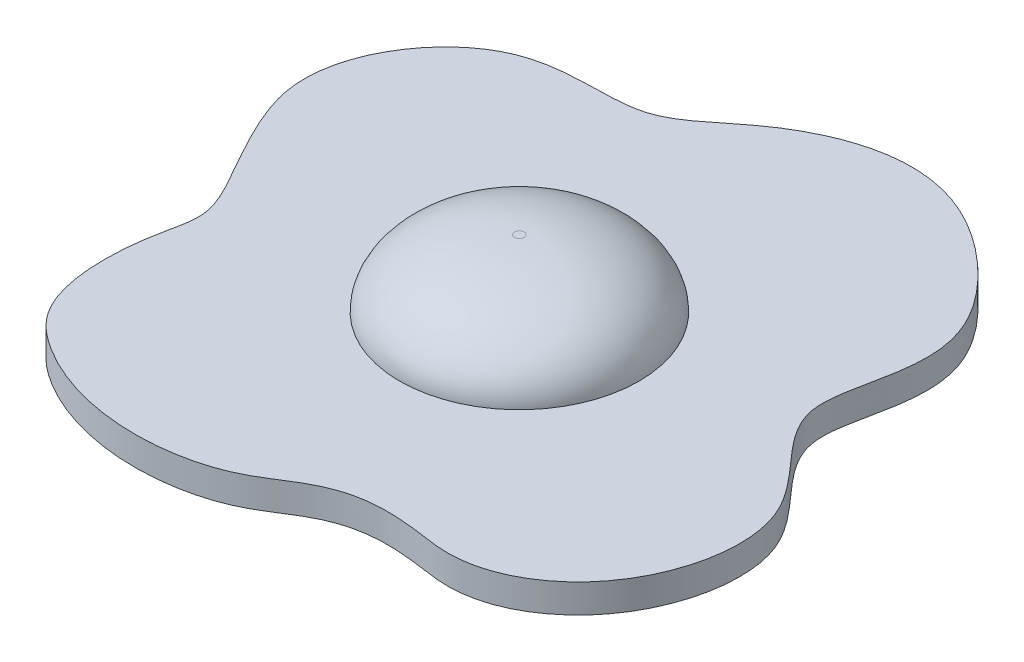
ISO-10303-21;
HEADER;
FILE_DESCRIPTION(('STEP AP214'),'2;1');
FILE_NAME('part.step','',(''),(''),'','','');
FILE_SCHEMA(('AUTOMOTIVE_DESIGN { 1 0 10303 214 1 1 1 1 }'));
ENDSEC;
DATA;
#1=APPLICATION_CONTEXT('core data for automotive mechanical design processes');
#2=APPLICATION_PROTOCOL_DEFINITION('international standard','automotive_design',2000,#1);
#3=PRODUCT_CONTEXT('',#1,'mechanical');
#4=PRODUCT('Part','Part','',(#3));
#5=PRODUCT_RELATED_PRODUCT_CATEGORY('part','',(#4));
#6=PRODUCT_DEFINITION_FORMATION('','',#4);
#7=PRODUCT_DEFINITION_CONTEXT('part definition',#1,'design');
#8=PRODUCT_DEFINITION('design','',#6,#7);
#9=PRODUCT_DEFINITION_SHAPE('','',#8);
#10=(LENGTH_UNIT() NAMED_UNIT(*) SI_UNIT(.MILLI.,.METRE.));
#11=(NAMED_UNIT(*) PLANE_ANGLE_UNIT() SI_UNIT($,.RADIAN.));
#12=(NAMED_UNIT(*) SI_UNIT($,.STERADIAN.) SOLID_ANGLE_UNIT());
#13=UNCERTAINTY_MEASURE_WITH_UNIT(LENGTH_MEASURE(1.E-05),#10,'distance_accuracy_value','');
#14=(GEOMETRIC_REPRESENTATION_CONTEXT(3) GLOBAL_UNCERTAINTY_ASSIGNED_CONTEXT((#13)) GLOBAL_UNIT_ASSIGNED_CONTEXT((#10,
#11,#12)) REPRESENTATION_CONTEXT('',''));
#15=CARTESIAN_POINT('',(0.,0.,0.));
#16=DIRECTION('',(0.,0.,1.));
#17=DIRECTION('',(1.,0.,0.));
#18=AXIS2_PLACEMENT_3D('',#15,#16,#17);
#19=CARTESIAN_POINT('',(0.,10.,0.));
#20=DIRECTION('',(0.,1.,0.));
#21=DIRECTION('',(0.,0.,1.));
#22=AXIS2_PLACEMENT_3D('',#19,#20,#21);
#23=PLANE('',#22);
#24=CARTESIAN_POINT('',(0.,10.,0.5));
#25=CARTESIAN_POINT('',(-0.0654498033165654,10.,0.5));
#26=CARTESIAN_POINT('',(-0.130873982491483,10.,0.486986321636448));
#27=CARTESIAN_POINT('',(-0.251809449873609,10.,0.436893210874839));
#28=CARTESIAN_POINT('',(-0.307273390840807,10.,0.399833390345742));
#29=CARTESIAN_POINT('',(-0.399833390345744,10.,0.307273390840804));
#30=CARTESIAN_POINT('',(-0.436893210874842,10.,0.251809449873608));
#31=CARTESIAN_POINT('',(-0.486986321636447,10.,0.13087398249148));
#32=CARTESIAN_POINT('',(-0.5,10.,0.0654498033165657));
#33=CARTESIAN_POINT('',(-0.5,10.,-0.0654498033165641));
#34=CARTESIAN_POINT('',(-0.486986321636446,10.,-0.130873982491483));
#35=CARTESIAN_POINT('',(-0.436893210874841,10.,-0.251809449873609));
#36=CARTESIAN_POINT('',(-0.399833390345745,10.,-0.307273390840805));
#37=CARTESIAN_POINT('',(-0.307273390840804,10.,-0.399833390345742));
#38=CARTESIAN_POINT('',(-0.251809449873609,10.,-0.436893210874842));
#39=CARTESIAN_POINT('',(-0.13087398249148,10.,-0.486986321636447));
#40=CARTESIAN_POINT('',(-0.0654498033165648,10.,-0.5));
#41=CARTESIAN_POINT('',(0.0654498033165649,10.,-0.5));
#42=CARTESIAN_POINT('',(0.130873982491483,10.,-0.486986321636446));
#43=CARTESIAN_POINT('',(0.251809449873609,10.,-0.436893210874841));
#44=CARTESIAN_POINT('',(0.307273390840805,10.,-0.399833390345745));
#45=CARTESIAN_POINT('',(0.399833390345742,10.,-0.307273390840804));
#46=CARTESIAN_POINT('',(0.43689321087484,10.,-0.251809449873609));
#47=CARTESIAN_POINT('',(0.486986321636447,10.,-0.130873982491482));
#48=CARTESIAN_POINT('',(0.5,10.,-0.0654498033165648));
#49=CARTESIAN_POINT('',(0.5,10.,0.0654498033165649));
#50=CARTESIAN_POINT('',(0.486986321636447,10.,0.130873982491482));
#51=CARTESIAN_POINT('',(0.436893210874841,10.,0.251809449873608));
#52=CARTESIAN_POINT('',(0.399833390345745,10.,0.307273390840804));
#53=CARTESIAN_POINT('',(0.307273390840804,10.,0.399833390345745));
#54=CARTESIAN_POINT('',(0.251809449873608,10.,0.43689321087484));
#55=CARTESIAN_POINT('',(0.130873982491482,10.,0.486986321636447));
#56=CARTESIAN_POINT('',(0.0654498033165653,10.,0.5));
#57=CARTESIAN_POINT('',(0.,10.,0.5));
#58=(BOUNDED_CURVE() B_SPLINE_CURVE(3,(#24,#25,#26,#27,#28,#29,#30,#31,#32,#33,#34,#35,#36,#37,
#38,#39,#40,#41,#42,#43,#44,#45,#46,#47,#48,#49,#50,#51,#52,#53,#54,#55,#56,#57),.UNSPECIFIED.,
.T.,.F.) B_SPLINE_CURVE_WITH_KNOTS((4,2,2,2,2,2,2,2,2,2,2,2,2,2,2,2,4),(0.,0.392699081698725,
0.785398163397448,1.17809724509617,1.5707963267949,1.96349540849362,2.35619449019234,
2.74889357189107,3.14159265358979,3.53429173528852,3.92699081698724,4.31968989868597,
4.71238898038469,5.10508806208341,5.49778714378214,5.89048622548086,6.28318530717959),
.UNSPECIFIED.) CURVE() GEOMETRIC_REPRESENTATION_ITEM() RATIONAL_B_SPLINE_CURVE((1.,1.,1.,1.,1.,
1.,1.,1.,1.,1.,1.,1.,1.,1.,1.,1.,1.,1.,1.,1.,1.,1.,1.,1.,1.,1.,1.,1.,1.,1.,1.,1.,1.,1.)) REPRESENTATION_ITEM(''));
#59=CARTESIAN_POINT('',(0.,10.,0.5));
#60=VERTEX_POINT('',#59);
#61=EDGE_CURVE('E58',#60,#60,#58,.F.);
#62=ORIENTED_EDGE('',*,*,#61,.T.);
#63=EDGE_LOOP('',(#62));
#64=FACE_BOUND('',#63,.T.);
#65=ADVANCED_FACE('F44',(#64),#23,.T.);
#66=CARTESIAN_POINT('',(0.,10.,0.5));
#67=CARTESIAN_POINT('',(0.0654498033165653,10.,0.5));
#68=CARTESIAN_POINT('',(0.130873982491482,10.,0.486986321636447));
#69=CARTESIAN_POINT('',(0.251809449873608,10.,0.43689321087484));
#70=CARTESIAN_POINT('',(0.307273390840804,10.,0.399833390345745));
#71=CARTESIAN_POINT('',(0.399833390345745,10.,0.307273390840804));
#72=CARTESIAN_POINT('',(0.436893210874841,10.,0.251809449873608));
#73=CARTESIAN_POINT('',(0.486986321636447,10.,0.130873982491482));
#74=CARTESIAN_POINT('',(0.5,10.,0.0654498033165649));
#75=CARTESIAN_POINT('',(0.5,10.,-0.0654498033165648));
#76=CARTESIAN_POINT('',(0.486986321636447,10.,-0.130873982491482));
#77=CARTESIAN_POINT('',(0.43689321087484,10.,-0.251809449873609));
#78=CARTESIAN_POINT('',(0.399833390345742,10.,-0.307273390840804));
#79=CARTESIAN_POINT('',(0.307273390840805,10.,-0.399833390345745));
#80=CARTESIAN_POINT('',(0.251809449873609,10.,-0.436893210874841));
#81=CARTESIAN_POINT('',(0.130873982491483,10.,-0.486986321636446));
#82=CARTESIAN_POINT('',(0.0654498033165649,10.,-0.5));
#83=CARTESIAN_POINT('',(-0.0654498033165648,10.,-0.5));
#84=CARTESIAN_POINT('',(-0.13087398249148,10.,-0.486986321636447));
#85=CARTESIAN_POINT('',(-0.251809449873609,10.,-0.436893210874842));
#86=CARTESIAN_POINT('',(-0.307273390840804,10.,-0.399833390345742));
#87=CARTESIAN_POINT('',(-0.399833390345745,10.,-0.307273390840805));
#88=CARTESIAN_POINT('',(-0.436893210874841,10.,-0.251809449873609));
#89=CARTESIAN_POINT('',(-0.486986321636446,10.,-0.130873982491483));
#90=CARTESIAN_POINT('',(-0.5,10.,-0.0654498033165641));
#91=CARTESIAN_POINT('',(-0.5,10.,0.0654498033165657));
#92=CARTESIAN_POINT('',(-0.486986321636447,10.,0.13087398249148));
#93=CARTESIAN_POINT('',(-0.436893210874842,10.,0.251809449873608));
#94=CARTESIAN_POINT('',(-0.399833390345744,10.,0.307273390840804));
#95=CARTESIAN_POINT('',(-0.307273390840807,10.,0.399833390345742));
#96=CARTESIAN_POINT('',(-0.251809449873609,10.,0.436893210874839));
#97=CARTESIAN_POINT('',(-0.130873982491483,10.,0.486986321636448));
#98=CARTESIAN_POINT('',(-0.0654498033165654,10.,0.5));
#99=CARTESIAN_POINT('',(0.,10.,0.5));
#100=CARTESIAN_POINT('',(0.,10.,12.5));
#101=CARTESIAN_POINT('',(1.63624508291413,9.99999999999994,12.4999999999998));
#102=CARTESIAN_POINT('',(3.27184956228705,10.0000000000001,12.1746580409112));
#103=CARTESIAN_POINT('',(6.29523624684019,9.99999999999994,10.9223302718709));
#104=CARTESIAN_POINT('',(7.68183477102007,10.,9.99583475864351));
#105=CARTESIAN_POINT('',(9.99583475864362,10.,7.68183477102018));
#106=CARTESIAN_POINT('',(10.922330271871,10.0000000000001,6.29523624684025));
#107=CARTESIAN_POINT('',(12.1746580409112,9.99999999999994,3.27184956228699));
#108=CARTESIAN_POINT('',(12.5,10.,1.63624508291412));
#109=CARTESIAN_POINT('',(12.5,10.,-1.63624508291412));
#110=CARTESIAN_POINT('',(12.174658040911,10.0000000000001,-3.271849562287));
#111=CARTESIAN_POINT('',(10.9223302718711,9.99999999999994,-6.29523624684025));
#112=CARTESIAN_POINT('',(9.99583475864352,10.0000000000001,-7.68183477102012));
#113=CARTESIAN_POINT('',(7.68183477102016,9.99999999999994,-9.99583475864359));
#114=CARTESIAN_POINT('',(6.29523624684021,10.,-10.922330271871));
#115=CARTESIAN_POINT('',(3.27184956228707,10.,-12.1746580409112));
#116=CARTESIAN_POINT('',(1.63624508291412,10.,-12.5));
#117=CARTESIAN_POINT('',(-1.63624508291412,10.,-12.5));
#118=CARTESIAN_POINT('',(-3.27184956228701,9.99999999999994,-12.1746580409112));
#119=CARTESIAN_POINT('',(-6.2952362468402,10.0000000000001,-10.9223302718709));
#120=CARTESIAN_POINT('',(-7.68183477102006,10.,-9.99583475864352));
#121=CARTESIAN_POINT('',(-9.99583475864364,10.,-7.68183477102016));
#122=CARTESIAN_POINT('',(-10.922330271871,10.0000000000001,-6.29523624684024));
#123=CARTESIAN_POINT('',(-12.1746580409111,9.99999999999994,-3.27184956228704));
#124=CARTESIAN_POINT('',(-12.5,9.99999999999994,-1.6362450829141));
#125=CARTESIAN_POINT('',(-12.5,10.0000000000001,1.63624508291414));
#126=CARTESIAN_POINT('',(-12.1746580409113,10.,3.27184956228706));
#127=CARTESIAN_POINT('',(-10.9223302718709,10.,6.29523624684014));
#128=CARTESIAN_POINT('',(-9.9958347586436,10.0000000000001,7.68183477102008));
#129=CARTESIAN_POINT('',(-7.68183477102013,9.99999999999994,9.99583475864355));
#130=CARTESIAN_POINT('',(-6.29523624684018,9.99999999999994,10.922330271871));
#131=CARTESIAN_POINT('',(-3.2718495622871,10.0000000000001,12.1746580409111));
#132=CARTESIAN_POINT('',(-1.63624508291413,10.0000000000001,12.5000000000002));
#133=CARTESIAN_POINT('',(0.,10.,12.5));
#134=CARTESIAN_POINT('',(0.,3.,12.5));
#135=CARTESIAN_POINT('',(1.63624508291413,3.,12.5));
#136=CARTESIAN_POINT('',(3.27184956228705,3.,12.1746580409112));
#137=CARTESIAN_POINT('',(6.2952362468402,3.,10.922330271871));
#138=CARTESIAN_POINT('',(7.68183477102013,3.,9.99583475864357));
#139=CARTESIAN_POINT('',(9.99583475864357,3.,7.68183477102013));
#140=CARTESIAN_POINT('',(10.922330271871,3.,6.29523624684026));
#141=CARTESIAN_POINT('',(12.1746580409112,3.,3.27184956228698));
#142=CARTESIAN_POINT('',(12.5,3.,1.63624508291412));
#143=CARTESIAN_POINT('',(12.5,3.,-1.63624508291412));
#144=CARTESIAN_POINT('',(12.1746580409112,3.,-3.27184956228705));
#145=CARTESIAN_POINT('',(10.922330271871,3.,-6.2952362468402));
#146=CARTESIAN_POINT('',(9.99583475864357,3.,-7.68183477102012));
#147=CARTESIAN_POINT('',(7.6818347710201,3.,-9.99583475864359));
#148=CARTESIAN_POINT('',(6.29523624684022,3.,-10.922330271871));
#149=CARTESIAN_POINT('',(3.27184956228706,3.,-12.1746580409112));
#150=CARTESIAN_POINT('',(1.63624508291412,3.,-12.5));
#151=CARTESIAN_POINT('',(-1.63624508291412,3.,-12.5));
#152=CARTESIAN_POINT('',(-3.27184956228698,3.,-12.1746580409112));
#153=CARTESIAN_POINT('',(-6.29523624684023,3.,-10.922330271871));
#154=CARTESIAN_POINT('',(-7.68183477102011,3.,-9.99583475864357));
#155=CARTESIAN_POINT('',(-9.99583475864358,3.,-7.6818347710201));
#156=CARTESIAN_POINT('',(-10.922330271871,3.,-6.29523624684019));
#157=CARTESIAN_POINT('',(-12.1746580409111,3.,-3.27184956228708));
#158=CARTESIAN_POINT('',(-12.5,3.,-1.6362450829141));
#159=CARTESIAN_POINT('',(-12.5,3.,1.63624508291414));
#160=CARTESIAN_POINT('',(-12.1746580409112,3.,3.271849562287));
#161=CARTESIAN_POINT('',(-10.922330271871,3.,6.2952362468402));
#162=CARTESIAN_POINT('',(-9.9958347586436,3.,7.68183477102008));
#163=CARTESIAN_POINT('',(-7.68183477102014,3.,9.99583475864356));
#164=CARTESIAN_POINT('',(-6.2952362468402,3.,10.922330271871));
#165=CARTESIAN_POINT('',(-3.27184956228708,3.,12.1746580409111));
#166=CARTESIAN_POINT('',(-1.63624508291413,3.,12.5));
#167=CARTESIAN_POINT('',(0.,3.,12.5));
#168=(BOUNDED_SURFACE() B_SPLINE_SURFACE(2,3,((#66,#67,#68,#69,#70,#71,#72,#73,#74,#75,#76,#77,
#78,#79,#80,#81,#82,#83,#84,#85,#86,#87,#88,#89,#90,#91,#92,#93,#94,#95,#96,#97,#98,#99),(#100,
#101,#102,#103,#104,#105,#106,#107,#108,#109,#110,#111,#112,#113,#114,#115,#116,#117,#118,#119,
#120,#121,#122,#123,#124,#125,#126,#127,#128,#129,#130,#131,#132,#133),(#134,#135,#136,#137,
#138,#139,#140,#141,#142,#143,#144,#145,#146,#147,#148,#149,#150,#151,#152,#153,#154,#155,#156,
#157,#158,#159,#160,#161,#162,#163,#164,#165,#166,#167)),.UNSPECIFIED.,.F.,.T.,
.F.) B_SPLINE_SURFACE_WITH_KNOTS((3,3),(4,2,2,2,2,2,2,2,2,2,2,2,2,2,2,2,4),(0.,1.),(0.,
0.392699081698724,0.785398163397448,1.17809724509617,1.5707963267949,1.96349540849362,
2.35619449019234,2.74889357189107,3.14159265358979,3.53429173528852,3.92699081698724,
4.31968989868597,4.71238898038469,5.10508806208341,5.49778714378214,5.89048622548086,
6.28318530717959),.UNSPECIFIED.) GEOMETRIC_REPRESENTATION_ITEM() RATIONAL_B_SPLINE_SURFACE(((1.,
1.,1.,1.,1.,1.,1.,1.,1.,1.,1.,1.,1.,1.,1.,1.,1.,1.,1.,1.,1.,1.,1.,1.,1.,1.,1.,1.,1.,1.,1.,1.,1.,
1.),(0.707106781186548,0.707106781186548,0.707106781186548,0.707106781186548,0.707106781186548,
0.707106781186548,0.707106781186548,0.707106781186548,0.707106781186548,0.707106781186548,
0.707106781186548,0.707106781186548,0.707106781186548,0.707106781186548,0.707106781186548,
0.707106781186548,0.707106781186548,0.707106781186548,0.707106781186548,0.707106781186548,
0.707106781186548,0.707106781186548,0.707106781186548,0.707106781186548,0.707106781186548,
0.707106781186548,0.707106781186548,0.707106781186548,0.707106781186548,0.707106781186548,
0.707106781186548,0.707106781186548,0.707106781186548,0.707106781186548),(1.,1.,1.,1.,1.,1.,1.,
1.,1.,1.,1.,1.,1.,1.,1.,1.,1.,1.,1.,1.,1.,1.,1.,1.,1.,1.,1.,1.,1.,1.,1.,1.,1.,1.))) REPRESENTATION_ITEM('') SURFACE());
#169=CARTESIAN_POINT('',(0.,3.,12.5));
#170=CARTESIAN_POINT('',(1.63624508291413,3.,12.5));
#171=CARTESIAN_POINT('',(3.27184956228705,3.,12.1746580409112));
#172=CARTESIAN_POINT('',(6.2952362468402,3.,10.922330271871));
#173=CARTESIAN_POINT('',(7.68183477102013,3.,9.99583475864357));
#174=CARTESIAN_POINT('',(9.99583475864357,3.,7.68183477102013));
#175=CARTESIAN_POINT('',(10.922330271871,3.,6.29523624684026));
#176=CARTESIAN_POINT('',(12.1746580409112,3.,3.27184956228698));
#177=CARTESIAN_POINT('',(12.5,3.,1.63624508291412));
#178=CARTESIAN_POINT('',(12.5,3.,-1.63624508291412));
#179=CARTESIAN_POINT('',(12.1746580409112,3.,-3.27184956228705));
#180=CARTESIAN_POINT('',(10.922330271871,3.,-6.2952362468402));
#181=CARTESIAN_POINT('',(9.99583475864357,3.,-7.68183477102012));
#182=CARTESIAN_POINT('',(7.6818347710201,3.,-9.99583475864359));
#183=CARTESIAN_POINT('',(6.29523624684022,3.,-10.922330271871));
#184=CARTESIAN_POINT('',(3.27184956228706,3.,-12.1746580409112));
#185=CARTESIAN_POINT('',(1.63624508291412,3.,-12.5));
#186=CARTESIAN_POINT('',(-1.63624508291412,3.,-12.5));
#187=CARTESIAN_POINT('',(-3.27184956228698,3.,-12.1746580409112));
#188=CARTESIAN_POINT('',(-6.29523624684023,3.,-10.922330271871));
#189=CARTESIAN_POINT('',(-7.68183477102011,3.,-9.99583475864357));
#190=CARTESIAN_POINT('',(-9.99583475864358,3.,-7.6818347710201));
#191=CARTESIAN_POINT('',(-10.922330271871,3.,-6.29523624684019));
#192=CARTESIAN_POINT('',(-12.1746580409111,3.,-3.27184956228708));
#193=CARTESIAN_POINT('',(-12.5,3.,-1.6362450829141));
#194=CARTESIAN_POINT('',(-12.5,3.,1.63624508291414));
#195=CARTESIAN_POINT('',(-12.1746580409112,3.,3.271849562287));
#196=CARTESIAN_POINT('',(-10.922330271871,3.,6.2952362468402));
#197=CARTESIAN_POINT('',(-9.9958347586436,3.,7.68183477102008));
#198=CARTESIAN_POINT('',(-7.68183477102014,3.,9.99583475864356));
#199=CARTESIAN_POINT('',(-6.2952362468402,3.,10.922330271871));
#200=CARTESIAN_POINT('',(-3.27184956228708,3.,12.1746580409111));
#201=CARTESIAN_POINT('',(-1.63624508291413,3.,12.5));
#202=CARTESIAN_POINT('',(0.,3.,12.5));
#203=(BOUNDED_CURVE() B_SPLINE_CURVE(3,(#169,#170,#171,#172,#173,#174,#175,#176,#177,#178,#179,
#180,#181,#182,#183,#184,#185,#186,#187,#188,#189,#190,#191,#192,#193,#194,#195,#196,#197,#198,
#199,#200,#201,#202),.UNSPECIFIED.,.T.,.F.) B_SPLINE_CURVE_WITH_KNOTS((4,2,2,2,2,2,2,2,2,2,2,2,
2,2,2,2,4),(0.,0.392699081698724,0.785398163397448,1.17809724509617,1.5707963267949,
1.96349540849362,2.35619449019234,2.74889357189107,3.14159265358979,3.53429173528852,
3.92699081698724,4.31968989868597,4.71238898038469,5.10508806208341,5.49778714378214,
5.89048622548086,6.28318530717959),
.UNSPECIFIED.) CURVE() GEOMETRIC_REPRESENTATION_ITEM() RATIONAL_B_SPLINE_CURVE((1.,1.,1.,1.,1.,
1.,1.,1.,1.,1.,1.,1.,1.,1.,1.,1.,1.,1.,1.,1.,1.,1.,1.,1.,1.,1.,1.,1.,1.,1.,1.,1.,1.,1.)) REPRESENTATION_ITEM(''));
#204=CARTESIAN_POINT('',(0.,3.,12.5));
#205=VERTEX_POINT('',#204);
#206=EDGE_CURVE('E11',#205,#205,#203,.F.);
#207=ORIENTED_EDGE('',*,*,#206,.F.);
#208=EDGE_LOOP('',(#207));
#209=FACE_BOUND('',#208,.T.);
#210=ORIENTED_EDGE('',*,*,#61,.F.);
#211=EDGE_LOOP('',(#210));
#212=FACE_BOUND('',#211,.T.);
#213=ADVANCED_FACE('F47',(#209,#212),#168,.T.);
#214=CARTESIAN_POINT('',(0.,3.,-31.9074489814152));
#215=CARTESIAN_POINT('',(-5.60120659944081,3.,-29.3679618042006));
#216=CARTESIAN_POINT('',(-9.78881026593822,3.,-22.3309548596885));
#217=CARTESIAN_POINT('',(-25.076665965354,3.,-26.2602815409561));
#218=CARTESIAN_POINT('',(-34.0776854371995,3.,-12.9094136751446));
#219=CARTESIAN_POINT('',(-29.9975622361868,3.,-1.02213956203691));
#220=CARTESIAN_POINT('',(-24.2387824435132,3.,6.70956480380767));
#221=CARTESIAN_POINT('',(-26.4443984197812,3.,11.7952039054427));
#222=CARTESIAN_POINT('',(-26.9622783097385,3.,23.2991524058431));
#223=CARTESIAN_POINT('',(-15.9831013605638,3.,32.124169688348));
#224=CARTESIAN_POINT('',(1.0749754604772,3.,31.7251355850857));
#225=CARTESIAN_POINT('',(6.3987030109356,3.,23.5909416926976));
#226=CARTESIAN_POINT('',(21.0063267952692,3.,26.3521532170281));
#227=CARTESIAN_POINT('',(31.2928952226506,3.,20.1235881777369));
#228=CARTESIAN_POINT('',(34.5293518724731,3.,2.98330493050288));
#229=CARTESIAN_POINT('',(19.9505525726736,3.,-4.94382134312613));
#230=CARTESIAN_POINT('',(29.3808402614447,3.,-19.7239692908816));
#231=CARTESIAN_POINT('',(12.2590355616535,3.,-35.6038155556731));
#232=CARTESIAN_POINT('',(3.54199548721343,3.,-33.5133265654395));
#233=CARTESIAN_POINT('',(0.,3.,-31.9074489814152));
#234=B_SPLINE_CURVE_WITH_KNOTS('',3,(#214,#215,#216,#217,#218,#219,#220,#221,#222,#223,#224,
#225,#226,#227,#228,#229,#230,#231,#232,#233),.UNSPECIFIED.,.T.,.F.,(4,1,1,1,1,1,1,1,1,1,1,1,1,
1,1,1,1,4),(0.,0.081032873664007,0.15831171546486,0.243457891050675,0.259610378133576,
0.319836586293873,0.367315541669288,0.435557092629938,0.457489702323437,0.586641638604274,
0.680373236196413,0.695842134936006,0.741330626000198,0.794912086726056,0.85251753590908,
0.90929784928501,0.948757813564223,1.),.UNSPECIFIED.);
#235=DIRECTION('',(0.,-1.,0.));
#236=VECTOR('',#235,1.);
#237=SURFACE_OF_LINEAR_EXTRUSION('',#234,#236);
#238=CARTESIAN_POINT('',(0.,3.,-31.9074489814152));
#239=VERTEX_POINT('',#238);
#240=EDGE_CURVE('E64',#239,#239,#234,.T.);
#241=ORIENTED_EDGE('',*,*,#240,.F.);
#242=EDGE_LOOP('',(#241));
#243=FACE_BOUND('',#242,.T.);
#244=CARTESIAN_POINT('',(0.,0.,-31.9074489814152));
#245=CARTESIAN_POINT('',(-5.60120659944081,0.,-29.3679618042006));
#246=CARTESIAN_POINT('',(-9.78881026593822,0.,-22.3309548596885));
#247=CARTESIAN_POINT('',(-25.076665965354,0.,-26.2602815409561));
#248=CARTESIAN_POINT('',(-34.0776854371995,0.,-12.9094136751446));
#249=CARTESIAN_POINT('',(-29.9975622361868,0.,-1.02213956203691));
#250=CARTESIAN_POINT('',(-24.2387824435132,0.,6.70956480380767));
#251=CARTESIAN_POINT('',(-26.4443984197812,0.,11.7952039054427));
#252=CARTESIAN_POINT('',(-26.9622783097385,0.,23.2991524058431));
#253=CARTESIAN_POINT('',(-15.9831013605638,0.,32.124169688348));
#254=CARTESIAN_POINT('',(1.0749754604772,0.,31.7251355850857));
#255=CARTESIAN_POINT('',(6.3987030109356,0.,23.5909416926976));
#256=CARTESIAN_POINT('',(21.0063267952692,0.,26.3521532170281));
#257=CARTESIAN_POINT('',(31.2928952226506,0.,20.1235881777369));
#258=CARTESIAN_POINT('',(34.5293518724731,0.,2.98330493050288));
#259=CARTESIAN_POINT('',(19.9505525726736,0.,-4.94382134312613));
#260=CARTESIAN_POINT('',(29.3808402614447,0.,-19.7239692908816));
#261=CARTESIAN_POINT('',(12.2590355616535,0.,-35.6038155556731));
#262=CARTESIAN_POINT('',(3.54199548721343,0.,-33.5133265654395));
#263=CARTESIAN_POINT('',(0.,0.,-31.9074489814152));
#264=B_SPLINE_CURVE_WITH_KNOTS('',3,(#244,#245,#246,#247,#248,#249,#250,#251,#252,#253,#254,
#255,#256,#257,#258,#259,#260,#261,#262,#263),.UNSPECIFIED.,.T.,.F.,(4,1,1,1,1,1,1,1,1,1,1,1,1,
1,1,1,1,4),(0.,0.081032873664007,0.15831171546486,0.243457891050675,0.259610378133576,
0.319836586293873,0.367315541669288,0.435557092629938,0.457489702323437,0.586641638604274,
0.680373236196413,0.695842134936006,0.741330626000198,0.794912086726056,0.85251753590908,
0.90929784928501,0.948757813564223,1.),.UNSPECIFIED.);
#265=CARTESIAN_POINT('',(0.,0.,-31.9074489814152));
#266=VERTEX_POINT('',#265);
#267=EDGE_CURVE('E70',#266,#266,#264,.T.);
#268=ORIENTED_EDGE('',*,*,#267,.T.);
#269=EDGE_LOOP('',(#268));
#270=FACE_BOUND('',#269,.T.);
#271=ADVANCED_FACE('F86',(#243,#270),#237,.F.);
#272=CARTESIAN_POINT('',(-14.0402750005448,3.,30.6088381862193));
#273=DIRECTION('',(0.,1.,0.));
#274=DIRECTION('',(0.,0.,1.));
#275=AXIS2_PLACEMENT_3D('',#272,#273,#274);
#276=PLANE('',#275);
#277=ORIENTED_EDGE('',*,*,#206,.T.);
#278=EDGE_LOOP('',(#277));
#279=FACE_BOUND('',#278,.T.);
#280=ORIENTED_EDGE('',*,*,#240,.T.);
#281=EDGE_LOOP('',(#280));
#282=FACE_BOUND('',#281,.T.);
#283=ADVANCED_FACE('F90',(#279,#282),#276,.T.);
#284=CARTESIAN_POINT('',(0.,0.,0.));
#285=DIRECTION('',(0.,1.,0.));
#286=DIRECTION('',(0.,0.,1.));
#287=AXIS2_PLACEMENT_3D('',#284,#285,#286);
#288=PLANE('',#287);
#289=ORIENTED_EDGE('',*,*,#267,.F.);
#290=EDGE_LOOP('',(#289));
#291=FACE_BOUND('',#290,.T.);
#292=ADVANCED_FACE('F95',(#291),#288,.F.);
#293=CLOSED_SHELL('',(#65,#213,#271,#283,#292));
#294=MANIFOLD_SOLID_BREP('B2',#293);
#295=ADVANCED_BREP_SHAPE_REPRESENTATION('',(#18,#294),#14);
#296=SHAPE_DEFINITION_REPRESENTATION(#9,#295);
ENDSEC;
END-ISO-10303-21;
